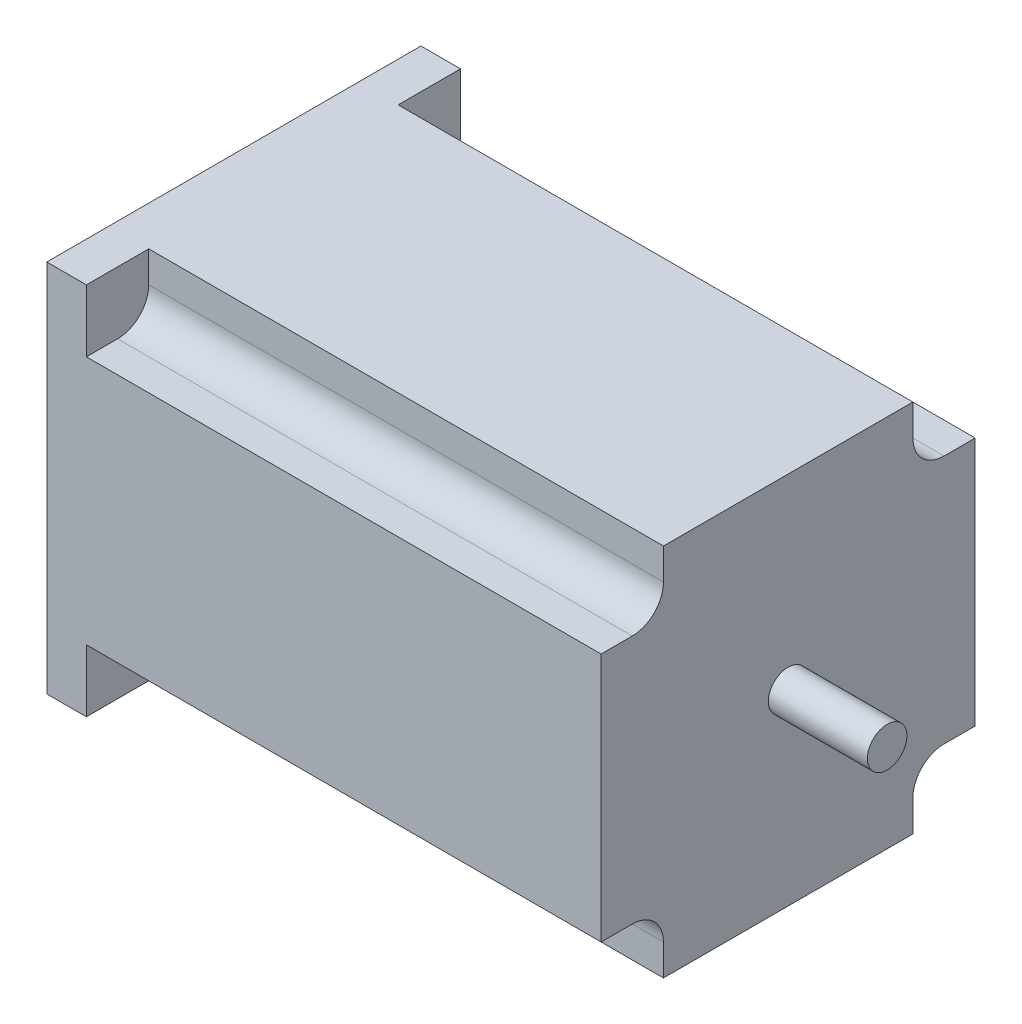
from build123d import *

# Parameters (mm, degrees)
SKETCH2_W            = 60
SKETCH2_H            = 60
BOSS_EXTRUDE2_DEPTH  = 88.9
CUT_EXTRUDE1_DEPTH   = 82.55
MIRROR2_COPY_1_DEPTH = 82.55
SKETCH7_R            = 19.05
BOSS_EXTRUDE3_DEPTH  = 1.5
SKETCH11_R           = 3.175
BOSS_EXTRUDE4_DEPTH  = 22.225
BOSS_EXTRUDE5_START  = 15.875
SKETCH12_R           = 3.175
BOSS_EXTRUDE5_DEPTH  = 15.875


with BuildPart() as part:
    # Sketch2 → Boss-Extrude2 (new body)
    with BuildSketch(Plane(origin=(88.9, 0, 0), x_dir=(0, 0, -1), z_dir=(1, 0, 0))):
        Rectangle(SKETCH2_W, SKETCH2_H)
    extrude(amount=-BOSS_EXTRUDE2_DEPTH)

    # Sketch6 → Cut-Extrude1 (cut)
    with BuildSketch(Plane(origin=(88.9, 0, 0), x_dir=(0, 0, -1), z_dir=(1, 0, 0))):
        with BuildLine():
            Line((30, 30), (20, 30))
            Line((20, 30), (20, 25))
            ThreePointArc((20, 25), (21.464466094, 21.464466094), (25, 20))
            Line((25, 20), (30, 20))
            Line((30, 20), (30, 30))
        make_face()
    cut_extrude1 = extrude(amount=-CUT_EXTRUDE1_DEPTH, mode=Mode.SUBTRACT)

    # Mirror1: Cut-Extrude1 across plane
    add(cut_extrude1.mirror(Plane.ZX), mode=Mode.SUBTRACT)

    # Mirror2: Cut-Extrude1 across plane
    add(cut_extrude1.mirror(Plane.XY), mode=Mode.SUBTRACT)

    # Mirror2 copy 1 sketch → Mirror2 copy 1 (cut)
    with BuildSketch(Plane(origin=(88.9, 0, 0), x_dir=(0, 0, 1), z_dir=(1, 0, 0))):
        with BuildLine():
            Line((30, 30), (20, 30))
            Line((20, 30), (20, 25))
            ThreePointArc((20, 25), (21.464466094, 21.464466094), (25, 20))
            Line((25, 20), (30, 20))
            Line((30, 20), (30, 30))
        make_face()
    extrude(amount=-MIRROR2_COPY_1_DEPTH, mode=Mode.SUBTRACT)

    # Sketch7 → Boss-Extrude3 (add)
    with BuildSketch(Plane(origin=(0, 0, 0), x_dir=(0, 0, -1), z_dir=(1, 0, 0))):
        Circle(SKETCH7_R)
    extrude(amount=-BOSS_EXTRUDE3_DEPTH)

    # Sketch11 → Boss-Extrude4 (add)
    with BuildSketch(Plane.ZY.offset(1.5)):
        with Locations(Location((0, 0, 0), (0, 0, 180))):
            Circle(SKETCH11_R)
    extrude(amount=BOSS_EXTRUDE4_DEPTH)

    # Sketch12 → Boss-Extrude5 (add)
    with BuildSketch(Plane(origin=(88.9, 0, 0), x_dir=(0, 0, -1), z_dir=(1, 0, 0)).offset(BOSS_EXTRUDE5_START)):
        Circle(SKETCH12_R)
    extrude(amount=-BOSS_EXTRUDE5_DEPTH)


solid = part.part
